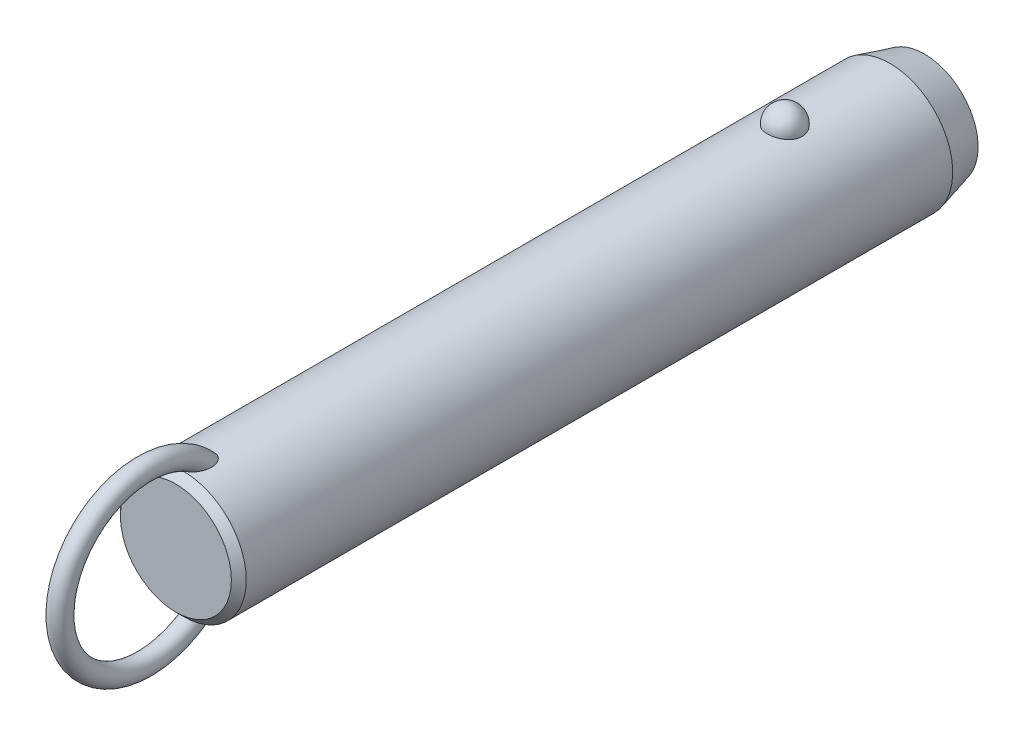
ISO-10303-21;
HEADER;
FILE_DESCRIPTION(('STEP AP214'),'2;1');
FILE_NAME('part.step','',(''),(''),'','','');
FILE_SCHEMA(('AUTOMOTIVE_DESIGN { 1 0 10303 214 1 1 1 1 }'));
ENDSEC;
DATA;
#1=APPLICATION_CONTEXT('core data for automotive mechanical design processes');
#2=APPLICATION_PROTOCOL_DEFINITION('international standard','automotive_design',2000,#1);
#3=PRODUCT_CONTEXT('',#1,'mechanical');
#4=PRODUCT('Part','Part','',(#3));
#5=PRODUCT_RELATED_PRODUCT_CATEGORY('part','',(#4));
#6=PRODUCT_DEFINITION_FORMATION('','',#4);
#7=PRODUCT_DEFINITION_CONTEXT('part definition',#1,'design');
#8=PRODUCT_DEFINITION('design','',#6,#7);
#9=PRODUCT_DEFINITION_SHAPE('','',#8);
#10=(LENGTH_UNIT() NAMED_UNIT(*) SI_UNIT(.MILLI.,.METRE.));
#11=(NAMED_UNIT(*) PLANE_ANGLE_UNIT() SI_UNIT($,.RADIAN.));
#12=(NAMED_UNIT(*) SI_UNIT($,.STERADIAN.) SOLID_ANGLE_UNIT());
#13=UNCERTAINTY_MEASURE_WITH_UNIT(LENGTH_MEASURE(1.E-05),#10,'distance_accuracy_value','');
#14=(GEOMETRIC_REPRESENTATION_CONTEXT(3) GLOBAL_UNCERTAINTY_ASSIGNED_CONTEXT((#13)) GLOBAL_UNIT_ASSIGNED_CONTEXT((#10,
#11,#12)) REPRESENTATION_CONTEXT('',''));
#15=CARTESIAN_POINT('',(0.,0.,0.));
#16=DIRECTION('',(0.,0.,1.));
#17=DIRECTION('',(1.,0.,0.));
#18=AXIS2_PLACEMENT_3D('',#15,#16,#17);
#19=CARTESIAN_POINT('',(0.,0.,106.7));
#20=DIRECTION('',(0.,0.,-1.));
#21=DIRECTION('',(-1.,0.,0.));
#22=AXIS2_PLACEMENT_3D('',#19,#20,#21);
#23=CYLINDRICAL_SURFACE('',#22,12.7);
#24=CARTESIAN_POINT('',(3.46661256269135,12.2177165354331,-3.5));
#25=CARTESIAN_POINT('',(3.4666090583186,12.2177194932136,-3.30432790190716));
#26=CARTESIAN_POINT('',(3.45063567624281,12.2222841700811,-3.10861112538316));
#27=CARTESIAN_POINT('',(3.38712451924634,12.2400345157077,-2.72271899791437));
#28=CARTESIAN_POINT('',(3.33957415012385,12.2532236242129,-2.53254588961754));
#29=CARTESIAN_POINT('',(3.2141234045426,12.286724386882,-2.16324948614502));
#30=CARTESIAN_POINT('',(3.13623639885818,12.3070329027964,-1.98412136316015));
#31=CARTESIAN_POINT('',(2.95205930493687,12.3525018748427,-1.64180592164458));
#32=CARTESIAN_POINT('',(2.84577003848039,12.3776621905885,-1.47861814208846));
#33=CARTESIAN_POINT('',(2.60688050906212,12.4301712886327,-1.17190583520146));
#34=CARTESIAN_POINT('',(2.47415697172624,12.4575299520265,-1.02847897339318));
#35=CARTESIAN_POINT('',(2.18615174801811,12.5112810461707,-0.766177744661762));
#36=CARTESIAN_POINT('',(2.03087002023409,12.5376734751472,-0.64730342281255));
#37=CARTESIAN_POINT('',(1.70237334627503,12.5864761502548,-0.437732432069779));
#38=CARTESIAN_POINT('',(1.52920948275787,12.6088972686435,-0.346958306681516));
#39=CARTESIAN_POINT('',(1.16944170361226,12.6473352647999,-0.195750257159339));
#40=CARTESIAN_POINT('',(0.982839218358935,12.663352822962,-0.135313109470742));
#41=CARTESIAN_POINT('',(0.604961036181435,12.6869706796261,-0.0473241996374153));
#42=CARTESIAN_POINT('',(0.413823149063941,12.6947125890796,-0.0192185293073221));
#43=CARTESIAN_POINT('',(0.0293827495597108,12.7014203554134,0.00517254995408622));
#44=CARTESIAN_POINT('',(-0.163919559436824,12.7003870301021,0.00146092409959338));
#45=CARTESIAN_POINT('',(-0.544374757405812,12.689735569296,-0.0373939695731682));
#46=CARTESIAN_POINT('',(-0.731575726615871,12.6802364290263,-0.0721015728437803));
#47=CARTESIAN_POINT('',(-1.09733277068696,12.6538333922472,-0.171364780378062));
#48=CARTESIAN_POINT('',(-1.27588869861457,12.6369293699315,-0.235920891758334));
#49=CARTESIAN_POINT('',(-1.6204698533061,12.5973946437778,-0.393548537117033));
#50=CARTESIAN_POINT('',(-1.78641865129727,12.5747321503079,-0.486778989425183));
#51=CARTESIAN_POINT('',(-2.10030671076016,12.5261316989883,-0.699110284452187));
#52=CARTESIAN_POINT('',(-2.24824419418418,12.5001934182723,-0.818213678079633));
#53=CARTESIAN_POINT('',(-2.52491489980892,12.4472906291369,-1.08157124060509));
#54=CARTESIAN_POINT('',(-2.65324222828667,12.4203160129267,-1.22624992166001));
#55=CARTESIAN_POINT('',(-2.88410007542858,12.3687509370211,-1.53528325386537));
#56=CARTESIAN_POINT('',(-2.98662883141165,12.3441606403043,-1.69963924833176));
#57=CARTESIAN_POINT('',(-3.16432417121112,12.2998199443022,-2.04548497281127));
#58=CARTESIAN_POINT('',(-3.23917525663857,12.2801261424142,-2.22714424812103));
#59=CARTESIAN_POINT('',(-3.35800573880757,12.248167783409,-2.6009138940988));
#60=CARTESIAN_POINT('',(-3.4019860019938,12.2359030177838,-2.79302397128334));
#61=CARTESIAN_POINT('',(-3.45784812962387,12.2202347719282,-3.18140279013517));
#62=CARTESIAN_POINT('',(-3.46986123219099,12.2167950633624,-3.37765118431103));
#63=CARTESIAN_POINT('',(-3.46186273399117,12.2190638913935,-3.76943689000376));
#64=CARTESIAN_POINT('',(-3.44185196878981,12.2247721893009,-3.96497421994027));
#65=CARTESIAN_POINT('',(-3.37048652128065,12.2446381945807,-4.34881728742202));
#66=CARTESIAN_POINT('',(-3.31928253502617,12.2587552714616,-4.53715319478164));
#67=CARTESIAN_POINT('',(-3.18693461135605,12.2938237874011,-4.90231727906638));
#68=CARTESIAN_POINT('',(-3.1057895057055,12.3147754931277,-5.07914500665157));
#69=CARTESIAN_POINT('',(-2.91506431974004,12.3613125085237,-5.41732059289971));
#70=CARTESIAN_POINT('',(-2.80533587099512,12.3869217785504,-5.57858147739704));
#71=CARTESIAN_POINT('',(-2.560414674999,12.4398525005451,-5.88013283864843));
#72=CARTESIAN_POINT('',(-2.42522099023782,12.4671740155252,-6.02042254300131));
#73=CARTESIAN_POINT('',(-2.1323357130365,12.5205965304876,-6.27662798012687));
#74=CARTESIAN_POINT('',(-1.97456596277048,12.5466928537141,-6.3924554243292));
#75=CARTESIAN_POINT('',(-1.64115839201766,12.5946384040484,-6.59583547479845));
#76=CARTESIAN_POINT('',(-1.46552179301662,12.6164879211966,-6.68339001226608));
#77=CARTESIAN_POINT('',(-1.10356050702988,12.6532533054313,-6.82682153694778));
#78=CARTESIAN_POINT('',(-0.917391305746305,12.6682500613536,-6.8830698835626));
#79=CARTESIAN_POINT('',(-0.537836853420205,12.6900288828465,-6.96386887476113));
#80=CARTESIAN_POINT('',(-0.344452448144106,12.6968119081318,-6.9884232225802));
#81=CARTESIAN_POINT('',(0.0402577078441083,12.7013667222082,-7.00496469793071));
#82=CARTESIAN_POINT('',(0.231556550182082,12.6993008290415,-6.99753844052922));
#83=CARTESIAN_POINT('',(0.610105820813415,12.6867505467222,-6.9516636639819));
#84=CARTESIAN_POINT('',(0.797356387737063,12.6762664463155,-6.913216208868));
#85=CARTESIAN_POINT('',(1.16186657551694,12.6480587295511,-6.80658431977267));
#86=CARTESIAN_POINT('',(1.33915951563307,12.6303611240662,-6.73850666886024));
#87=CARTESIAN_POINT('',(1.67968518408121,12.5896027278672,-6.5745087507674));
#88=CARTESIAN_POINT('',(1.84291705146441,12.5665416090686,-6.47858678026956));
#89=CARTESIAN_POINT('',(2.15340192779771,12.5171072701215,-6.25982455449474));
#90=CARTESIAN_POINT('',(2.30037831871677,12.4906895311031,-6.13660186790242));
#91=CARTESIAN_POINT('',(2.5717412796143,12.4376567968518,-5.86739587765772));
#92=CARTESIAN_POINT('',(2.69612388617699,12.4110417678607,-5.72140858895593));
#93=CARTESIAN_POINT('',(2.92107785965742,12.360051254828,-5.40794137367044));
#94=CARTESIAN_POINT('',(3.02121329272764,12.3357209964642,-5.24014110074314));
#95=CARTESIAN_POINT('',(3.19236291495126,12.2925446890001,-4.88969865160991));
#96=CARTESIAN_POINT('',(3.26338839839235,12.2736965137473,-4.70706226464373));
#97=CARTESIAN_POINT('',(3.36788038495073,12.245404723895,-4.35469510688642));
#98=CARTESIAN_POINT('',(3.40484026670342,12.2351018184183,-4.18605935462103));
#99=CARTESIAN_POINT('',(3.45420764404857,12.2212564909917,-3.84496058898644));
#100=CARTESIAN_POINT('',(3.46661565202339,12.2177139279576,-3.67249765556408));
#101=CARTESIAN_POINT('',(3.46661256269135,12.2177165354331,-3.5));
#102=B_SPLINE_CURVE_WITH_KNOTS('',3,(#24,#25,#26,#27,#28,#29,#30,#31,#32,#33,#34,#35,#36,#37,
#38,#39,#40,#41,#42,#43,#44,#45,#46,#47,#48,#49,#50,#51,#52,#53,#54,#55,#56,#57,#58,#59,#60,#61,
#62,#63,#64,#65,#66,#67,#68,#69,#70,#71,#72,#73,#74,#75,#76,#77,#78,#79,#80,#81,#82,#83,#84,#85,
#86,#87,#88,#89,#90,#91,#92,#93,#94,#95,#96,#97,#98,#99,#100,#101),.UNSPECIFIED.,.T.,.F.,(4,2,2,
2,2,2,2,2,2,2,2,2,2,2,2,2,2,2,2,2,2,2,2,2,2,2,2,2,2,2,2,2,2,2,2,2,2,2,4),(0.,0.586396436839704,
1.17302689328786,1.7593990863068,2.34575431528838,2.93491084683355,3.52406845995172,
4.11158733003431,4.69904375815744,5.2762784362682,5.85345931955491,6.42265312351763,
6.99185659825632,7.56427334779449,8.136746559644,8.71981013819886,9.3029135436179,
9.89247258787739,10.4820150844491,11.0691335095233,11.6562366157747,12.2405256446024,
12.8248374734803,13.412244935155,13.9996740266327,14.5891883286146,15.1786623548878,
15.7609861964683,16.3432419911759,16.914863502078,17.4864654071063,18.056024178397,
18.6256177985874,19.2037609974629,19.7820055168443,20.3699810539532,20.9577282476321,
21.4746855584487,21.9916320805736),.UNSPECIFIED.);
#103=CARTESIAN_POINT('',(3.46661256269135,12.2177165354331,-3.5));
#104=VERTEX_POINT('',#103);
#105=EDGE_CURVE('E41',#104,#104,#102,.T.);
#106=ORIENTED_EDGE('',*,*,#105,.T.);
#107=EDGE_LOOP('',(#106));
#108=FACE_BOUND('',#107,.T.);
#109=CARTESIAN_POINT('',(0.,0.,117.9));
#110=DIRECTION('',(0.,0.,1.));
#111=DIRECTION('',(1.,0.,0.));
#112=AXIS2_PLACEMENT_3D('',#109,#110,#111);
#113=CIRCLE('',#112,12.7);
#114=CARTESIAN_POINT('',(12.7,0.,117.9));
#115=VERTEX_POINT('',#114);
#116=EDGE_CURVE('E10',#115,#115,#113,.F.);
#117=ORIENTED_EDGE('',*,*,#116,.T.);
#118=EDGE_LOOP('',(#117));
#119=FACE_BOUND('',#118,.T.);
#120=CARTESIAN_POINT('',(-0.548122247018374,-12.6881662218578,111.643218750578));
#121=CARTESIAN_POINT('',(-0.648865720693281,-12.6838128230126,111.677926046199));
#122=CARTESIAN_POINT('',(-0.746398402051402,-12.6783867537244,111.722042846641));
#123=CARTESIAN_POINT('',(-0.93212506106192,-12.666091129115,111.826764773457));
#124=CARTESIAN_POINT('',(-1.02030388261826,-12.6592192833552,111.887396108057));
#125=CARTESIAN_POINT('',(-1.18487740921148,-12.6448747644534,112.021847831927));
#126=CARTESIAN_POINT('',(-1.26134296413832,-12.637406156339,112.095582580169));
#127=CARTESIAN_POINT('',(-1.40231200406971,-12.6225412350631,112.253604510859));
#128=CARTESIAN_POINT('',(-1.46681470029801,-12.6151449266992,112.33789238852));
#129=CARTESIAN_POINT('',(-1.60714786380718,-12.5981718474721,112.549657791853));
#130=CARTESIAN_POINT('',(-1.67725126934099,-12.588900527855,112.680962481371));
#131=CARTESIAN_POINT('',(-1.79536591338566,-12.5725964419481,112.953247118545));
#132=CARTESIAN_POINT('',(-1.84333535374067,-12.5655679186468,113.094244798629));
#133=CARTESIAN_POINT('',(-1.93422576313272,-12.5519624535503,113.437645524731));
#134=CARTESIAN_POINT('',(-1.96788773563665,-12.5466298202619,113.642557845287));
#135=CARTESIAN_POINT('',(-1.9941399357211,-12.542463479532,113.951760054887));
#136=CARTESIAN_POINT('',(-1.99883864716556,-12.5417153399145,114.055298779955));
#137=CARTESIAN_POINT('',(-2.00078003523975,-12.5414074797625,114.26245124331));
#138=CARTESIAN_POINT('',(-1.99802449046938,-12.5418474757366,114.366064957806));
#139=CARTESIAN_POINT('',(-1.98336733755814,-12.5441750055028,114.610320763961));
#140=CARTESIAN_POINT('',(-1.96851430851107,-12.5465291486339,114.750780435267));
#141=CARTESIAN_POINT('',(-1.92707089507,-12.5529612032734,115.029960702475));
#142=CARTESIAN_POINT('',(-1.90047458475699,-12.5570399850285,115.168680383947));
#143=CARTESIAN_POINT('',(-1.8361912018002,-12.5666008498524,115.44341135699));
#144=CARTESIAN_POINT('',(-1.79850828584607,-12.57208240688,115.579423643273));
#145=CARTESIAN_POINT('',(-1.71223796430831,-12.5841228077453,115.847842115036));
#146=CARTESIAN_POINT('',(-1.66365679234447,-12.5906810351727,115.980250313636));
#147=CARTESIAN_POINT('',(-1.57804503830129,-12.6016176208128,116.18548877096));
#148=CARTESIAN_POINT('',(-1.5447725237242,-12.6057501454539,116.259914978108));
#149=CARTESIAN_POINT('',(-1.47424480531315,-12.6141930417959,116.406839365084));
#150=CARTESIAN_POINT('',(-1.436990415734,-12.6185033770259,116.479337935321));
#151=CARTESIAN_POINT('',(-1.35825795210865,-12.6272207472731,116.621892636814));
#152=CARTESIAN_POINT('',(-1.31678520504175,-12.6316276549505,116.691951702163));
#153=CARTESIAN_POINT('',(-1.22917793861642,-12.6404532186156,116.829070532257));
#154=CARTESIAN_POINT('',(-1.18304514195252,-12.6448718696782,116.896131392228));
#155=CARTESIAN_POINT('',(-1.07246411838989,-12.6547893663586,117.043874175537));
#156=CARTESIAN_POINT('',(-1.00642239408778,-12.6602600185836,117.123384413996));
#157=CARTESIAN_POINT('',(-0.864441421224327,-12.6707460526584,117.273169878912));
#158=CARTESIAN_POINT('',(-0.788516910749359,-12.6757620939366,117.343458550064));
#159=CARTESIAN_POINT('',(-0.652215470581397,-12.6833591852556,117.448680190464));
#160=CARTESIAN_POINT('',(-0.594982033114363,-12.6861973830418,117.487624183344));
#161=CARTESIAN_POINT('',(-0.475269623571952,-12.6912445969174,117.556489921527));
#162=CARTESIAN_POINT('',(-0.412800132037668,-12.6934547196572,117.586427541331));
#163=CARTESIAN_POINT('',(-0.295749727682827,-12.6966636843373,117.629756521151));
#164=CARTESIAN_POINT('',(-0.241949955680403,-12.6978134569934,117.645218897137));
#165=CARTESIAN_POINT('',(-0.132508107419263,-12.6994261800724,117.666884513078));
#166=CARTESIAN_POINT('',(-0.0768679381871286,-12.6998898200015,117.673097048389));
#167=CARTESIAN_POINT('',(0.0347696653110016,-12.7000752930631,117.675583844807));
#168=CARTESIAN_POINT('',(0.0907676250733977,-12.6997954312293,117.671835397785));
#169=CARTESIAN_POINT('',(0.201283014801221,-12.6985255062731,117.654788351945));
#170=CARTESIAN_POINT('',(0.255799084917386,-12.6975348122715,117.641481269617));
#171=CARTESIAN_POINT('',(0.376042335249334,-12.6946091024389,117.60203792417));
#172=CARTESIAN_POINT('',(0.440950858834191,-12.6924943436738,117.573449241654));
#173=CARTESIAN_POINT('',(0.565350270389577,-12.6875639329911,117.506323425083));
#174=CARTESIAN_POINT('',(0.624828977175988,-12.6847467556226,117.467764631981));
#175=CARTESIAN_POINT('',(0.774116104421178,-12.6767252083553,117.356949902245));
#176=CARTESIAN_POINT('',(0.859449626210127,-12.6711344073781,117.278760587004));
#177=CARTESIAN_POINT('',(1.01789440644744,-12.6593922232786,117.110943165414));
#178=CARTESIAN_POINT('',(1.09096902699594,-12.653239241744,117.021282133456));
#179=CARTESIAN_POINT('',(1.22268793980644,-12.6411674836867,116.840265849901));
#180=CARTESIAN_POINT('',(1.28193986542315,-12.6352572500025,116.749345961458));
#181=CARTESIAN_POINT('',(1.39259777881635,-12.6235401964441,116.562792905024));
#182=CARTESIAN_POINT('',(1.44399707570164,-12.6177334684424,116.467155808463));
#183=CARTESIAN_POINT('',(1.53972870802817,-12.6064093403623,116.272273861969));
#184=CARTESIAN_POINT('',(1.58405262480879,-12.6008922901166,116.173024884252));
#185=CARTESIAN_POINT('',(1.66600705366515,-12.5903187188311,115.971772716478));
#186=CARTESIAN_POINT('',(1.70363651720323,-12.5852622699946,115.869769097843));
#187=CARTESIAN_POINT('',(1.7754537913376,-12.5753406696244,115.654358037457));
#188=CARTESIAN_POINT('',(1.80903453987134,-12.5705328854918,115.540745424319));
#189=CARTESIAN_POINT('',(1.86844163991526,-12.5618400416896,115.311457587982));
#190=CARTESIAN_POINT('',(1.89426665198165,-12.5579551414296,115.195782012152));
#191=CARTESIAN_POINT('',(1.93785464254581,-12.5513030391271,114.963007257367));
#192=CARTESIAN_POINT('',(1.95562640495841,-12.5485346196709,114.845909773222));
#193=CARTESIAN_POINT('',(1.98264463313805,-12.5442934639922,114.610747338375));
#194=CARTESIAN_POINT('',(1.99189298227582,-12.5428204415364,114.49268260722));
#195=CARTESIAN_POINT('',(2.00416068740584,-12.540871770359,114.180622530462));
#196=CARTESIAN_POINT('',(1.99944433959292,-12.541631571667,113.986229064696));
#197=CARTESIAN_POINT('',(1.9611375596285,-12.5476846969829,113.600309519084));
#198=CARTESIAN_POINT('',(1.92758341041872,-12.5529723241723,113.408780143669));
#199=CARTESIAN_POINT('',(1.83934342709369,-12.5661532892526,113.082272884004));
#200=CARTESIAN_POINT('',(1.79215440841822,-12.5730485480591,112.94524997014));
#201=CARTESIAN_POINT('',(1.67676242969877,-12.588958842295,112.680445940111));
#202=CARTESIAN_POINT('',(1.60859050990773,-12.597970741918,112.552651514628));
#203=CARTESIAN_POINT('',(1.4658383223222,-12.6152829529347,112.335800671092));
#204=CARTESIAN_POINT('',(1.39525727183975,-12.6233659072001,112.24410500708));
#205=CARTESIAN_POINT('',(1.2399259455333,-12.6395676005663,112.073485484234));
#206=CARTESIAN_POINT('',(1.15517932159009,-12.6476863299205,111.994558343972));
#207=CARTESIAN_POINT('',(0.971995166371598,-12.6630846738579,111.852643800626));
#208=CARTESIAN_POINT('',(0.873456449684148,-12.6703572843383,111.789784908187));
#209=CARTESIAN_POINT('',(0.665847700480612,-12.6829569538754,111.684487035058));
#210=CARTESIAN_POINT('',(0.556784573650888,-12.688285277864,111.642034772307));
#211=CARTESIAN_POINT('',(0.347338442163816,-12.6956226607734,111.584443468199));
#212=CARTESIAN_POINT('',(0.247759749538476,-12.6979816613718,111.566399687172));
#213=CARTESIAN_POINT('',(0.0470218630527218,-12.7003077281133,111.548600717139));
#214=CARTESIAN_POINT('',(-0.0541350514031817,-12.7002779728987,111.548821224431));
#215=CARTESIAN_POINT('',(-0.221414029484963,-12.6982482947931,111.564363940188));
#216=CARTESIAN_POINT('',(-0.28805588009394,-12.6969033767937,111.574666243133));
#217=CARTESIAN_POINT('',(-0.419599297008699,-12.6932369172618,111.60313489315));
#218=CARTESIAN_POINT('',(-0.484501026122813,-12.6909154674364,111.621300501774));
#219=CARTESIAN_POINT('',(-0.548122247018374,-12.6881662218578,111.643218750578));
#220=B_SPLINE_CURVE_WITH_KNOTS('',3,(#120,#121,#122,#123,#124,#125,#126,#127,#128,#129,#130,
#131,#132,#133,#134,#135,#136,#137,#138,#139,#140,#141,#142,#143,#144,#145,#146,#147,#148,#149,
#150,#151,#152,#153,#154,#155,#156,#157,#158,#159,#160,#161,#162,#163,#164,#165,#166,#167,#168,
#169,#170,#171,#172,#173,#174,#175,#176,#177,#178,#179,#180,#181,#182,#183,#184,#185,#186,#187,
#188,#189,#190,#191,#192,#193,#194,#195,#196,#197,#198,#199,#200,#201,#202,#203,#204,#205,#206,
#207,#208,#209,#210,#211,#212,#213,#214,#215,#216,#217,#218,#219),.UNSPECIFIED.,.T.,.F.,(4,2,2,
2,2,2,2,2,2,2,2,2,2,2,2,2,2,2,2,2,2,2,2,2,2,2,2,2,2,2,2,2,2,2,2,2,2,2,2,2,2,2,2,2,2,2,2,2,2,4),
(0.,0.319642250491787,0.639794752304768,0.957927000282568,1.27608021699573,1.72100165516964,
2.16675988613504,2.78630021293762,3.09705782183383,3.40774128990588,3.83096358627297,
4.25439969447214,4.67767724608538,5.10071330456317,5.34550297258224,5.59024267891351,
5.8346770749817,6.07902143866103,6.38891080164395,6.69834321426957,6.90560910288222,
7.11250749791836,7.27977315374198,7.44687060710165,7.61434932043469,7.78197685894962,
7.99365544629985,8.20579780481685,8.55147335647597,8.89816429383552,9.22375138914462,
9.54961437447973,9.87586224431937,10.202161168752,10.5575872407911,10.9130746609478,
11.2681734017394,11.6231936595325,12.2046601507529,12.7853961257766,13.219164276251,
13.6522938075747,13.9989174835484,14.3454519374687,14.6946768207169,15.0436740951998,
15.3457513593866,15.6474266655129,15.8493051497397,16.0511646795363),.UNSPECIFIED.);
#221=CARTESIAN_POINT('',(-0.548122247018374,-12.6881662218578,111.643218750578));
#222=VERTEX_POINT('',#221);
#223=EDGE_CURVE('E60',#222,#222,#220,.T.);
#224=ORIENTED_EDGE('',*,*,#223,.T.);
#225=EDGE_LOOP('',(#224));
#226=FACE_BOUND('',#225,.T.);
#227=CARTESIAN_POINT('',(-0.548122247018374,12.6881662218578,111.643218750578));
#228=CARTESIAN_POINT('',(-0.459436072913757,12.6919968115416,111.612673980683));
#229=CARTESIAN_POINT('',(-0.368189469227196,12.6949996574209,111.589391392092));
#230=CARTESIAN_POINT('',(-0.183024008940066,12.6990186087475,111.558406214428));
#231=CARTESIAN_POINT('',(-0.0891049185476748,12.7000345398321,111.550704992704));
#232=CARTESIAN_POINT('',(0.0987147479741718,12.6999636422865,111.551245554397));
#233=CARTESIAN_POINT('',(0.192615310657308,12.6988761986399,111.559492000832));
#234=CARTESIAN_POINT('',(0.377658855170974,12.6947211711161,111.591551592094));
#235=CARTESIAN_POINT('',(0.468801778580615,12.6916535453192,111.615365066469));
#236=CARTESIAN_POINT('',(0.645809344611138,12.6838788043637,111.67745651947));
#237=CARTESIAN_POINT('',(0.731679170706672,12.6791733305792,111.715720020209));
#238=CARTESIAN_POINT('',(0.896315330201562,12.6686004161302,111.805120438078));
#239=CARTESIAN_POINT('',(0.975080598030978,12.6627328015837,111.856259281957));
#240=CARTESIAN_POINT('',(1.12963655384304,12.6499161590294,111.97367820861));
#241=CARTESIAN_POINT('',(1.20478673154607,12.6429194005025,112.040792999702));
#242=CARTESIAN_POINT('',(1.34448241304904,12.6288282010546,112.18522507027));
#243=CARTESIAN_POINT('',(1.40902173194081,12.621733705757,112.262548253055));
#244=CARTESIAN_POINT('',(1.55208211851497,12.6050877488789,112.459247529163));
#245=CARTESIAN_POINT('',(1.62510490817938,12.5957546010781,112.582654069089));
#246=CARTESIAN_POINT('',(1.75019044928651,12.5789823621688,112.839769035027));
#247=CARTESIAN_POINT('',(1.80221377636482,12.5715468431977,112.973496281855));
#248=CARTESIAN_POINT('',(1.90309965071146,12.5567434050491,113.298351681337));
#249=CARTESIAN_POINT('',(1.94342317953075,12.5504515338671,113.492161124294));
#250=CARTESIAN_POINT('',(1.99332997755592,12.5426147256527,113.88378810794));
#251=CARTESIAN_POINT('',(2.00285305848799,12.5410790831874,114.081612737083));
#252=CARTESIAN_POINT('',(1.99678999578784,12.5420407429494,114.416642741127));
#253=CARTESIAN_POINT('',(1.98794117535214,12.5434564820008,114.554042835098));
#254=CARTESIAN_POINT('',(1.95865119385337,12.5480641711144,114.827639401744));
#255=CARTESIAN_POINT('',(1.9382043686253,12.5512569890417,114.963835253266));
#256=CARTESIAN_POINT('',(1.88647896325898,12.5591352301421,115.234249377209));
#257=CARTESIAN_POINT('',(1.85518800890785,12.5638223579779,115.36846520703));
#258=CARTESIAN_POINT('',(1.78217886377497,12.5743868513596,115.633936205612));
#259=CARTESIAN_POINT('',(1.74046509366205,12.5802637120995,115.765192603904));
#260=CARTESIAN_POINT('',(1.66024095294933,12.5910571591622,115.986085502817));
#261=CARTESIAN_POINT('',(1.62434772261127,12.5957535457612,116.076690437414));
#262=CARTESIAN_POINT('',(1.5470900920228,12.6054762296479,116.255512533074));
#263=CARTESIAN_POINT('',(1.50572681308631,12.6105024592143,116.343730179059));
#264=CARTESIAN_POINT('',(1.41728020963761,12.620748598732,116.516932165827));
#265=CARTESIAN_POINT('',(1.37021377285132,12.625967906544,116.601925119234));
#266=CARTESIAN_POINT('',(1.2696962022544,12.6364721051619,116.768007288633));
#267=CARTESIAN_POINT('',(1.21624929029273,12.6417569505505,116.849099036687));
#268=CARTESIAN_POINT('',(1.10304413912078,12.6521331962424,117.004702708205));
#269=CARTESIAN_POINT('',(1.04340936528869,12.657226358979,117.079303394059));
#270=CARTESIAN_POINT('',(0.915919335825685,12.6670906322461,117.221324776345));
#271=CARTESIAN_POINT('',(0.848064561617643,12.6718617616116,117.28874589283));
#272=CARTESIAN_POINT('',(0.717035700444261,12.67987711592,117.400624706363));
#273=CARTESIAN_POINT('',(0.655526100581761,12.6832377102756,117.446997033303));
#274=CARTESIAN_POINT('',(0.525985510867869,12.6892676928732,117.529619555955));
#275=CARTESIAN_POINT('',(0.457969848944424,12.6919386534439,117.565892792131));
#276=CARTESIAN_POINT('',(0.334859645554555,12.695691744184,117.616657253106));
#277=CARTESIAN_POINT('',(0.281116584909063,12.6970073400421,117.634373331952));
#278=CARTESIAN_POINT('',(0.17142581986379,12.6989609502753,117.660642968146));
#279=CARTESIAN_POINT('',(0.11548082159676,12.699599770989,117.669207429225));
#280=CARTESIAN_POINT('',(0.00272618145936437,12.7001251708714,117.676253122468));
#281=CARTESIAN_POINT('',(-0.0540859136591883,12.7000089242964,117.674696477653));
#282=CARTESIAN_POINT('',(-0.166544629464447,12.6990328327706,117.661600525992));
#283=CARTESIAN_POINT('',(-0.222190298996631,12.6981724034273,117.650053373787));
#284=CARTESIAN_POINT('',(-0.342018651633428,12.695562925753,117.614912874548));
#285=CARTESIAN_POINT('',(-0.405606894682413,12.6936676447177,117.58933225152));
#286=CARTESIAN_POINT('',(-0.527815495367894,12.6891754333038,117.528311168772));
#287=CARTESIAN_POINT('',(-0.586425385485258,12.6865770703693,117.492850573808));
#288=CARTESIAN_POINT('',(-0.731842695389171,12.6792129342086,117.391496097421));
#289=CARTESIAN_POINT('',(-0.814709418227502,12.6740767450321,117.3200395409));
#290=CARTESIAN_POINT('',(-0.969101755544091,12.6632083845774,117.16589007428));
#291=CARTESIAN_POINT('',(-1.04059564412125,12.6574746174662,117.083166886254));
#292=CARTESIAN_POINT('',(-1.16981116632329,12.6461638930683,116.915809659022));
#293=CARTESIAN_POINT('',(-1.22811369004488,12.6405994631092,116.831616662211));
#294=CARTESIAN_POINT('',(-1.3374340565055,12.6295007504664,116.658579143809));
#295=CARTESIAN_POINT('',(-1.38844577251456,12.6239664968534,116.569730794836));
#296=CARTESIAN_POINT('',(-1.4840070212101,12.6130898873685,116.388389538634));
#297=CARTESIAN_POINT('',(-1.52854232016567,12.6077479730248,116.295889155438));
#298=CARTESIAN_POINT('',(-1.61150113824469,12.5974127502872,116.108160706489));
#299=CARTESIAN_POINT('',(-1.64992317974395,12.5924195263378,116.012931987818));
#300=CARTESIAN_POINT('',(-1.73468589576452,12.581070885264,115.78289362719));
#301=CARTESIAN_POINT('',(-1.77831261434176,12.5749388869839,115.647066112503));
#302=CARTESIAN_POINT('',(-1.85439734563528,12.5639437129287,115.372212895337));
#303=CARTESIAN_POINT('',(-1.88684994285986,12.5590811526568,115.233185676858));
#304=CARTESIAN_POINT('',(-1.94008483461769,12.550968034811,114.95309235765));
#305=CARTESIAN_POINT('',(-1.96088706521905,12.5477147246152,114.812030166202));
#306=CARTESIAN_POINT('',(-1.99000539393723,12.5431291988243,114.528668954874));
#307=CARTESIAN_POINT('',(-1.99832911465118,12.5417958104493,114.386370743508));
#308=CARTESIAN_POINT('',(-2.00166624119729,12.5412674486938,114.057627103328));
#309=CARTESIAN_POINT('',(-1.99178843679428,12.5428579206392,113.871088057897));
#310=CARTESIAN_POINT('',(-1.9445518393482,12.5502731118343,113.50162404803));
#311=CARTESIAN_POINT('',(-1.90724032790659,12.5560905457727,113.318693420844));
#312=CARTESIAN_POINT('',(-1.81330718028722,12.5699462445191,113.004848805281));
#313=CARTESIAN_POINT('',(-1.76338820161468,12.5771273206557,112.871910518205));
#314=CARTESIAN_POINT('',(-1.64305018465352,12.593414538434,112.615681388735));
#315=CARTESIAN_POINT('',(-1.57265346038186,12.6025185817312,112.492380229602));
#316=CARTESIAN_POINT('',(-1.42634956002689,12.6198178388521,112.283564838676));
#317=CARTESIAN_POINT('',(-1.3542377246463,12.6278405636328,112.195384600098));
#318=CARTESIAN_POINT('',(-1.19645664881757,12.6437632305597,112.032107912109));
#319=CARTESIAN_POINT('',(-1.11080536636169,12.6516633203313,111.956994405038));
#320=CARTESIAN_POINT('',(-0.947219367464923,12.6648319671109,111.837811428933));
#321=CARTESIAN_POINT('',(-0.871624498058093,12.670300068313,111.790541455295));
#322=CARTESIAN_POINT('',(-0.714161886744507,12.6801492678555,111.7077413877));
#323=CARTESIAN_POINT('',(-0.632295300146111,12.684530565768,111.67220913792));
#324=CARTESIAN_POINT('',(-0.548122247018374,12.6881662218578,111.643218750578));
#325=B_SPLINE_CURVE_WITH_KNOTS('',3,(#227,#228,#229,#230,#231,#232,#233,#234,#235,#236,#237,
#238,#239,#240,#241,#242,#243,#244,#245,#246,#247,#248,#249,#250,#251,#252,#253,#254,#255,#256,
#257,#258,#259,#260,#261,#262,#263,#264,#265,#266,#267,#268,#269,#270,#271,#272,#273,#274,#275,
#276,#277,#278,#279,#280,#281,#282,#283,#284,#285,#286,#287,#288,#289,#290,#291,#292,#293,#294,
#295,#296,#297,#298,#299,#300,#301,#302,#303,#304,#305,#306,#307,#308,#309,#310,#311,#312,#313,
#314,#315,#316,#317,#318,#319,#320,#321,#322,#323,#324),.UNSPECIFIED.,.T.,.F.,(4,2,2,2,2,2,2,2,
2,2,2,2,2,2,2,2,2,2,2,2,2,2,2,2,2,2,2,2,2,2,2,2,2,2,2,2,2,2,2,2,2,2,2,2,2,2,2,2,4),(0.,
0.281328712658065,0.562682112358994,0.844117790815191,1.12555942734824,1.40671982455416,
1.68792232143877,1.98972294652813,2.29169886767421,2.72039860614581,3.14989948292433,
3.74084916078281,4.33295293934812,4.74554109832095,5.15833092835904,5.57159335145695,
5.98468079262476,6.27722775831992,6.56971484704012,6.86135609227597,7.15280542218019,
7.43927407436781,7.72572595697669,7.95635862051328,8.18646071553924,8.35559393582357,
8.52452541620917,8.69408946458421,8.86378678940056,9.06834348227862,9.27332014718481,
9.60010414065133,9.92778432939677,10.2350252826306,10.5425229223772,10.8506864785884,
11.1589244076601,11.5867893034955,12.0148612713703,12.4421984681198,12.8692745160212,
13.4279365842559,13.9856380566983,14.4107062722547,14.8353130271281,15.1765567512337,
15.5173516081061,15.7844129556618,16.051425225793),.UNSPECIFIED.);
#326=CARTESIAN_POINT('',(-0.548122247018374,12.6881662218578,111.643218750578));
#327=VERTEX_POINT('',#326);
#328=EDGE_CURVE('E67',#327,#327,#325,.T.);
#329=ORIENTED_EDGE('',*,*,#328,.T.);
#330=EDGE_LOOP('',(#329));
#331=FACE_BOUND('',#330,.T.);
#332=CARTESIAN_POINT('',(0.,0.,-24.7000000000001));
#333=DIRECTION('',(0.,0.,-1.));
#334=DIRECTION('',(-1.,0.,0.));
#335=AXIS2_PLACEMENT_3D('',#332,#333,#334);
#336=CIRCLE('',#335,12.7);
#337=CARTESIAN_POINT('',(-12.7,0.,-24.7000000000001));
#338=VERTEX_POINT('',#337);
#339=EDGE_CURVE('E57',#338,#338,#336,.F.);
#340=ORIENTED_EDGE('',*,*,#339,.T.);
#341=EDGE_LOOP('',(#340));
#342=FACE_BOUND('',#341,.T.);
#343=ADVANCED_FACE('F37',(#108,#119,#226,#331,#342),#23,.T.);
#344=CARTESIAN_POINT('',(0.,0.,-31.7));
#345=DIRECTION('',(0.,0.,-1.));
#346=DIRECTION('',(-1.,0.,0.));
#347=AXIS2_PLACEMENT_3D('',#344,#345,#346);
#348=PLANE('',#347);
#349=CARTESIAN_POINT('',(0.,0.,-31.7));
#350=DIRECTION('',(0.,0.,-1.));
#351=DIRECTION('',(-1.,0.,0.));
#352=AXIS2_PLACEMENT_3D('',#349,#350,#351);
#353=CIRCLE('',#352,10.8243556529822);
#354=CARTESIAN_POINT('',(-10.8243556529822,0.,-31.7));
#355=VERTEX_POINT('',#354);
#356=EDGE_CURVE('E66',#355,#355,#353,.T.);
#357=ORIENTED_EDGE('',*,*,#356,.T.);
#358=EDGE_LOOP('',(#357));
#359=FACE_BOUND('',#358,.T.);
#360=ADVANCED_FACE('F85',(#359),#348,.T.);
#361=CARTESIAN_POINT('',(0.,0.,-31.7));
#362=DIRECTION('',(0.,0.,1.));
#363=DIRECTION('',(1.,0.,0.));
#364=AXIS2_PLACEMENT_3D('',#361,#362,#363);
#365=CONICAL_SURFACE('',#364,10.8243556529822,0.261799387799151);
#366=ORIENTED_EDGE('',*,*,#339,.F.);
#367=EDGE_LOOP('',(#366));
#368=FACE_BOUND('',#367,.T.);
#369=ORIENTED_EDGE('',*,*,#356,.F.);
#370=EDGE_LOOP('',(#369));
#371=FACE_BOUND('',#370,.T.);
#372=ADVANCED_FACE('F83',(#368,#371),#365,.T.);
#373=CARTESIAN_POINT('',(0.,0.,119.4));
#374=DIRECTION('',(0.,0.,1.));
#375=DIRECTION('',(1.,0.,0.));
#376=AXIS2_PLACEMENT_3D('',#373,#374,#375);
#377=PLANE('',#376);
#378=CARTESIAN_POINT('',(0.,0.,119.4));
#379=DIRECTION('',(0.,0.,1.));
#380=DIRECTION('',(1.,0.,0.));
#381=AXIS2_PLACEMENT_3D('',#378,#379,#380);
#382=CIRCLE('',#381,11.2000000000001);
#383=CARTESIAN_POINT('',(11.2000000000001,0.,119.4));
#384=VERTEX_POINT('',#383);
#385=EDGE_CURVE('E50',#384,#384,#382,.T.);
#386=ORIENTED_EDGE('',*,*,#385,.T.);
#387=EDGE_LOOP('',(#386));
#388=FACE_BOUND('',#387,.T.);
#389=ADVANCED_FACE('F77',(#388),#377,.T.);
#390=CARTESIAN_POINT('',(0.,0.,125.75));
#391=DIRECTION('',(1.,0.,0.));
#392=DIRECTION('',(0.,0.,-1.));
#393=AXIS2_PLACEMENT_3D('',#390,#391,#392);
#394=TOROIDAL_SURFACE('',#393,17.05,2.);
#395=ORIENTED_EDGE('',*,*,#328,.F.);
#396=EDGE_LOOP('',(#395));
#397=FACE_BOUND('',#396,.T.);
#398=ORIENTED_EDGE('',*,*,#223,.F.);
#399=EDGE_LOOP('',(#398));
#400=FACE_BOUND('',#399,.T.);
#401=ADVANCED_FACE('F73',(#397,#400),#394,.T.);
#402=CARTESIAN_POINT('',(0.,0.,119.4));
#403=DIRECTION('',(0.,0.,-1.));
#404=DIRECTION('',(-1.,0.,0.));
#405=AXIS2_PLACEMENT_3D('',#402,#403,#404);
#406=CONICAL_SURFACE('',#405,11.2000000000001,0.785398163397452);
#407=ORIENTED_EDGE('',*,*,#116,.F.);
#408=EDGE_LOOP('',(#407));
#409=FACE_BOUND('',#408,.T.);
#410=ORIENTED_EDGE('',*,*,#385,.F.);
#411=EDGE_LOOP('',(#410));
#412=FACE_BOUND('',#411,.T.);
#413=ADVANCED_FACE('F39',(#409,#412),#406,.T.);
#414=CARTESIAN_POINT('',(0.,12.7,-3.5));
#415=DIRECTION('',(0.,1.,0.));
#416=DIRECTION('',(0.,0.,-1.));
#417=AXIS2_PLACEMENT_3D('',#414,#415,#416);
#418=SPHERICAL_SURFACE('',#417,3.5);
#419=ORIENTED_EDGE('',*,*,#105,.F.);
#420=EDGE_LOOP('',(#419));
#421=FACE_BOUND('',#420,.T.);
#422=ADVANCED_FACE('F79',(#421),#418,.T.);
#423=CLOSED_SHELL('',(#343,#360,#372,#389,#401,#413,#422));
#424=MANIFOLD_SOLID_BREP('B2',#423);
#425=ADVANCED_BREP_SHAPE_REPRESENTATION('',(#18,#424),#14);
#426=SHAPE_DEFINITION_REPRESENTATION(#9,#425);
ENDSEC;
END-ISO-10303-21;
